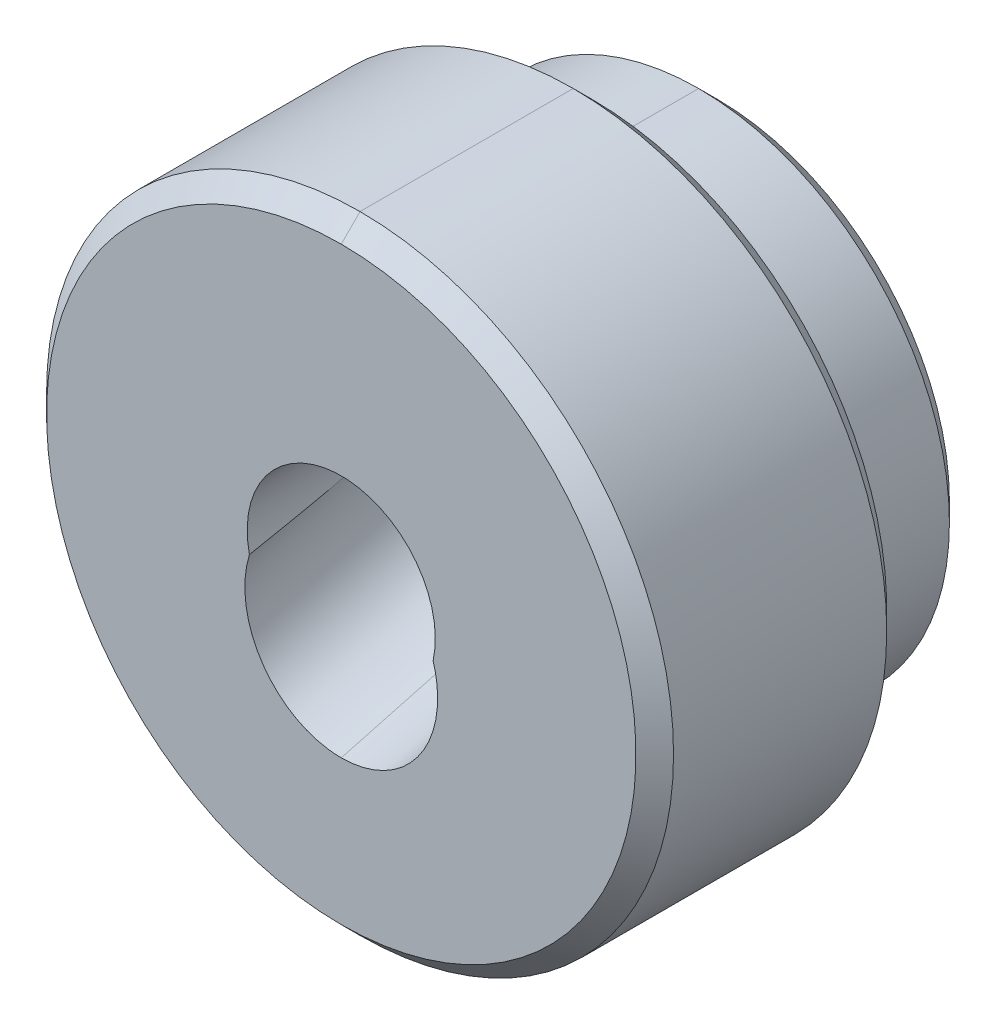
ISO-10303-21;
HEADER;
FILE_DESCRIPTION(('STEP AP214'),'2;1');
FILE_NAME('part.step','',(''),(''),'','','');
FILE_SCHEMA(('AUTOMOTIVE_DESIGN { 1 0 10303 214 1 1 1 1 }'));
ENDSEC;
DATA;
#1=APPLICATION_CONTEXT('core data for automotive mechanical design processes');
#2=APPLICATION_PROTOCOL_DEFINITION('international standard','automotive_design',2000,#1);
#3=PRODUCT_CONTEXT('',#1,'mechanical');
#4=PRODUCT('Part','Part','',(#3));
#5=PRODUCT_RELATED_PRODUCT_CATEGORY('part','',(#4));
#6=PRODUCT_DEFINITION_FORMATION('','',#4);
#7=PRODUCT_DEFINITION_CONTEXT('part definition',#1,'design');
#8=PRODUCT_DEFINITION('design','',#6,#7);
#9=PRODUCT_DEFINITION_SHAPE('','',#8);
#10=(LENGTH_UNIT() NAMED_UNIT(*) SI_UNIT(.MILLI.,.METRE.));
#11=(NAMED_UNIT(*) PLANE_ANGLE_UNIT() SI_UNIT($,.RADIAN.));
#12=(NAMED_UNIT(*) SI_UNIT($,.STERADIAN.) SOLID_ANGLE_UNIT());
#13=UNCERTAINTY_MEASURE_WITH_UNIT(LENGTH_MEASURE(1.E-05),#10,'distance_accuracy_value','');
#14=(GEOMETRIC_REPRESENTATION_CONTEXT(3) GLOBAL_UNCERTAINTY_ASSIGNED_CONTEXT((#13)) GLOBAL_UNIT_ASSIGNED_CONTEXT((#10,
#11,#12)) REPRESENTATION_CONTEXT('',''));
#15=CARTESIAN_POINT('',(0.,0.,0.));
#16=DIRECTION('',(0.,0.,1.));
#17=DIRECTION('',(1.,0.,0.));
#18=AXIS2_PLACEMENT_3D('',#15,#16,#17);
#19=CARTESIAN_POINT('',(0.,0.,6.8));
#20=DIRECTION('',(0.,0.,1.));
#21=DIRECTION('',(1.,0.,0.));
#22=AXIS2_PLACEMENT_3D('',#19,#20,#21);
#23=CYLINDRICAL_SURFACE('',#22,16.);
#24=CARTESIAN_POINT('',(0.,0.,6.8));
#25=DIRECTION('',(0.,0.,1.));
#26=DIRECTION('',(1.,0.,0.));
#27=AXIS2_PLACEMENT_3D('',#24,#25,#26);
#28=CIRCLE('',#27,16.);
#29=CARTESIAN_POINT('',(-16.,0.,6.8));
#30=VERTEX_POINT('',#29);
#31=CARTESIAN_POINT('',(0.,-16.,6.8));
#32=VERTEX_POINT('',#31);
#33=EDGE_CURVE('E409',#30,#32,#28,.T.);
#34=ORIENTED_EDGE('',*,*,#33,.F.);
#35=CARTESIAN_POINT('',(0.,0.,6.8));
#36=DIRECTION('',(0.,0.,1.));
#37=DIRECTION('',(1.,0.,0.));
#38=AXIS2_PLACEMENT_3D('',#35,#36,#37);
#39=CIRCLE('',#38,16.);
#40=CARTESIAN_POINT('',(0.,16.,6.8));
#41=VERTEX_POINT('',#40);
#42=EDGE_CURVE('E278',#41,#30,#39,.T.);
#43=ORIENTED_EDGE('',*,*,#42,.F.);
#44=DIRECTION('',(0.,0.,1.));
#45=VECTOR('',#44,1.);
#46=CARTESIAN_POINT('',(0.,16.,4.));
#47=LINE('',#46,#45);
#48=CARTESIAN_POINT('',(0.,16.,1.2));
#49=VERTEX_POINT('',#48);
#50=EDGE_CURVE('E115',#49,#41,#47,.T.);
#51=ORIENTED_EDGE('',*,*,#50,.F.);
#52=CARTESIAN_POINT('',(0.,0.,1.2));
#53=DIRECTION('',(0.,0.,-1.));
#54=DIRECTION('',(0.,1.,0.));
#55=AXIS2_PLACEMENT_3D('',#52,#53,#54);
#56=CIRCLE('',#55,16.);
#57=CARTESIAN_POINT('',(0.,-16.,1.2));
#58=VERTEX_POINT('',#57);
#59=EDGE_CURVE('E184',#58,#49,#56,.T.);
#60=ORIENTED_EDGE('',*,*,#59,.F.);
#61=DIRECTION('',(0.,0.,-1.));
#62=VECTOR('',#61,1.);
#63=CARTESIAN_POINT('',(0.,-16.,4.));
#64=LINE('',#63,#62);
#65=EDGE_CURVE('E411',#32,#58,#64,.T.);
#66=ORIENTED_EDGE('',*,*,#65,.F.);
#67=EDGE_LOOP('',(#34,#43,#51,#60,#66));
#68=FACE_BOUND('',#67,.T.);
#69=ADVANCED_FACE('F14',(#68),#23,.T.);
#70=CARTESIAN_POINT('',(0.,0.,6.8));
#71=DIRECTION('',(0.,0.,1.));
#72=DIRECTION('',(1.,0.,0.));
#73=AXIS2_PLACEMENT_3D('',#70,#71,#72);
#74=CYLINDRICAL_SURFACE('',#73,16.);
#75=ORIENTED_EDGE('',*,*,#65,.T.);
#76=CARTESIAN_POINT('',(0.,0.,1.2));
#77=DIRECTION('',(0.,0.,-1.));
#78=DIRECTION('',(0.,1.,0.));
#79=AXIS2_PLACEMENT_3D('',#76,#77,#78);
#80=CIRCLE('',#79,16.);
#81=EDGE_CURVE('E168',#49,#58,#80,.T.);
#82=ORIENTED_EDGE('',*,*,#81,.F.);
#83=ORIENTED_EDGE('',*,*,#50,.T.);
#84=CARTESIAN_POINT('',(0.,0.,6.8));
#85=DIRECTION('',(0.,0.,1.));
#86=DIRECTION('',(1.,0.,0.));
#87=AXIS2_PLACEMENT_3D('',#84,#85,#86);
#88=CIRCLE('',#87,16.);
#89=CARTESIAN_POINT('',(16.,0.,6.8));
#90=VERTEX_POINT('',#89);
#91=EDGE_CURVE('E276',#90,#41,#88,.T.);
#92=ORIENTED_EDGE('',*,*,#91,.F.);
#93=CARTESIAN_POINT('',(0.,0.,6.8));
#94=DIRECTION('',(0.,0.,1.));
#95=DIRECTION('',(1.,0.,0.));
#96=AXIS2_PLACEMENT_3D('',#93,#94,#95);
#97=CIRCLE('',#96,16.);
#98=EDGE_CURVE('E220',#32,#90,#97,.T.);
#99=ORIENTED_EDGE('',*,*,#98,.F.);
#100=EDGE_LOOP('',(#75,#82,#83,#92,#99));
#101=FACE_BOUND('',#100,.T.);
#102=ADVANCED_FACE('F403',(#101),#74,.T.);
#103=CARTESIAN_POINT('',(0.,0.,6.8));
#104=DIRECTION('',(0.,0.,1.));
#105=DIRECTION('',(1.,0.,0.));
#106=AXIS2_PLACEMENT_3D('',#103,#104,#105);
#107=TOROIDAL_SURFACE('',#106,17.2,1.2);
#108=CARTESIAN_POINT('',(17.2,0.,6.8));
#109=DIRECTION('',(0.,-1.,0.));
#110=DIRECTION('',(-1.,0.,0.));
#111=AXIS2_PLACEMENT_3D('',#108,#109,#110);
#112=CIRCLE('',#111,1.2);
#113=CARTESIAN_POINT('',(17.2,0.,8.));
#114=VERTEX_POINT('',#113);
#115=EDGE_CURVE('E219',#114,#90,#112,.T.);
#116=ORIENTED_EDGE('',*,*,#115,.F.);
#117=CARTESIAN_POINT('',(0.,0.,8.));
#118=DIRECTION('',(0.,0.,-1.));
#119=DIRECTION('',(1.,0.,0.));
#120=AXIS2_PLACEMENT_3D('',#117,#118,#119);
#121=CIRCLE('',#120,17.2);
#122=CARTESIAN_POINT('',(-17.2,0.,8.));
#123=VERTEX_POINT('',#122);
#124=EDGE_CURVE('E156',#123,#114,#121,.F.);
#125=ORIENTED_EDGE('',*,*,#124,.F.);
#126=CARTESIAN_POINT('',(-17.2,0.,6.8));
#127=DIRECTION('',(0.,1.,0.));
#128=DIRECTION('',(1.,0.,0.));
#129=AXIS2_PLACEMENT_3D('',#126,#127,#128);
#130=CIRCLE('',#129,1.2);
#131=EDGE_CURVE('E212',#30,#123,#130,.F.);
#132=ORIENTED_EDGE('',*,*,#131,.F.);
#133=ORIENTED_EDGE('',*,*,#33,.T.);
#134=ORIENTED_EDGE('',*,*,#98,.T.);
#135=EDGE_LOOP('',(#116,#125,#132,#133,#134));
#136=FACE_BOUND('',#135,.T.);
#137=ADVANCED_FACE('F197',(#136),#107,.F.);
#138=CARTESIAN_POINT('',(0.,0.,6.8));
#139=DIRECTION('',(0.,0.,1.));
#140=DIRECTION('',(1.,0.,0.));
#141=AXIS2_PLACEMENT_3D('',#138,#139,#140);
#142=TOROIDAL_SURFACE('',#141,17.2,1.2);
#143=ORIENTED_EDGE('',*,*,#91,.T.);
#144=ORIENTED_EDGE('',*,*,#42,.T.);
#145=ORIENTED_EDGE('',*,*,#131,.T.);
#146=CARTESIAN_POINT('',(0.,0.,8.));
#147=DIRECTION('',(0.,0.,-1.));
#148=DIRECTION('',(-1.,0.,0.));
#149=AXIS2_PLACEMENT_3D('',#146,#147,#148);
#150=CIRCLE('',#149,17.2);
#151=CARTESIAN_POINT('',(0.,17.2,8.));
#152=VERTEX_POINT('',#151);
#153=EDGE_CURVE('E162',#152,#123,#150,.F.);
#154=ORIENTED_EDGE('',*,*,#153,.F.);
#155=CARTESIAN_POINT('',(0.,0.,8.));
#156=DIRECTION('',(0.,0.,-1.));
#157=DIRECTION('',(0.,1.,0.));
#158=AXIS2_PLACEMENT_3D('',#155,#156,#157);
#159=CIRCLE('',#158,17.2);
#160=EDGE_CURVE('E151',#114,#152,#159,.F.);
#161=ORIENTED_EDGE('',*,*,#160,.F.);
#162=ORIENTED_EDGE('',*,*,#115,.T.);
#163=EDGE_LOOP('',(#143,#144,#145,#154,#161,#162));
#164=FACE_BOUND('',#163,.T.);
#165=ADVANCED_FACE('F191',(#164),#142,.F.);
#166=CARTESIAN_POINT('',(0.,0.,0.));
#167=DIRECTION('',(0.,0.,1.));
#168=DIRECTION('',(1.,0.,0.));
#169=AXIS2_PLACEMENT_3D('',#166,#167,#168);
#170=CONICAL_SURFACE('',#169,14.8,0.785398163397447);
#171=DIRECTION('',(0.,0.707106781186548,-0.707106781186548));
#172=VECTOR('',#171,1.);
#173=CARTESIAN_POINT('',(0.,-11.3137084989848,-3.48629150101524));
#174=LINE('',#173,#172);
#175=CARTESIAN_POINT('',(0.,-14.8,0.));
#176=VERTEX_POINT('',#175);
#177=EDGE_CURVE('E165',#58,#176,#174,.T.);
#178=ORIENTED_EDGE('',*,*,#177,.F.);
#179=ORIENTED_EDGE('',*,*,#59,.T.);
#180=DIRECTION('',(0.,0.707106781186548,0.707106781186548));
#181=VECTOR('',#180,1.);
#182=CARTESIAN_POINT('',(0.,11.3137084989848,-3.48629150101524));
#183=LINE('',#182,#181);
#184=CARTESIAN_POINT('',(0.,14.8,0.));
#185=VERTEX_POINT('',#184);
#186=EDGE_CURVE('E174',#185,#49,#183,.T.);
#187=ORIENTED_EDGE('',*,*,#186,.F.);
#188=CARTESIAN_POINT('',(0.,0.,0.));
#189=DIRECTION('',(0.,0.,1.));
#190=DIRECTION('',(1.,0.,0.));
#191=AXIS2_PLACEMENT_3D('',#188,#189,#190);
#192=CIRCLE('',#191,14.8);
#193=EDGE_CURVE('E148',#176,#185,#192,.F.);
#194=ORIENTED_EDGE('',*,*,#193,.F.);
#195=EDGE_LOOP('',(#178,#179,#187,#194));
#196=FACE_BOUND('',#195,.T.);
#197=ADVANCED_FACE('F196',(#196),#170,.T.);
#198=CARTESIAN_POINT('',(0.,0.,0.));
#199=DIRECTION('',(0.,0.,1.));
#200=DIRECTION('',(1.,0.,0.));
#201=AXIS2_PLACEMENT_3D('',#198,#199,#200);
#202=CONICAL_SURFACE('',#201,14.8,0.785398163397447);
#203=ORIENTED_EDGE('',*,*,#177,.T.);
#204=CARTESIAN_POINT('',(0.,0.,0.));
#205=DIRECTION('',(0.,0.,1.));
#206=DIRECTION('',(1.,0.,0.));
#207=AXIS2_PLACEMENT_3D('',#204,#205,#206);
#208=CIRCLE('',#207,14.8);
#209=EDGE_CURVE('E145',#185,#176,#208,.F.);
#210=ORIENTED_EDGE('',*,*,#209,.F.);
#211=ORIENTED_EDGE('',*,*,#186,.T.);
#212=ORIENTED_EDGE('',*,*,#81,.T.);
#213=EDGE_LOOP('',(#203,#210,#211,#212));
#214=FACE_BOUND('',#213,.T.);
#215=ADVANCED_FACE('F238',(#214),#202,.T.);
#216=CARTESIAN_POINT('',(19.0256021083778,18.8,8.));
#217=DIRECTION('',(0.,0.,-1.));
#218=DIRECTION('',(0.,-1.,0.));
#219=AXIS2_PLACEMENT_3D('',#216,#217,#218);
#220=PLANE('',#219);
#221=ORIENTED_EDGE('',*,*,#124,.T.);
#222=ORIENTED_EDGE('',*,*,#160,.T.);
#223=ORIENTED_EDGE('',*,*,#153,.T.);
#224=EDGE_LOOP('',(#221,#222,#223));
#225=FACE_BOUND('',#224,.T.);
#226=CARTESIAN_POINT('',(0.,0.,8.));
#227=DIRECTION('',(0.,0.,1.));
#228=DIRECTION('',(1.,0.,0.));
#229=AXIS2_PLACEMENT_3D('',#226,#227,#228);
#230=CIRCLE('',#229,18.8);
#231=CARTESIAN_POINT('',(0.,18.8,8.));
#232=VERTEX_POINT('',#231);
#233=CARTESIAN_POINT('',(0.,-18.8,8.));
#234=VERTEX_POINT('',#233);
#235=EDGE_CURVE('E140',#232,#234,#230,.T.);
#236=ORIENTED_EDGE('',*,*,#235,.F.);
#237=CARTESIAN_POINT('',(0.,0.,8.));
#238=DIRECTION('',(0.,0.,1.));
#239=DIRECTION('',(1.,0.,0.));
#240=AXIS2_PLACEMENT_3D('',#237,#238,#239);
#241=CIRCLE('',#240,18.8);
#242=EDGE_CURVE('E150',#234,#232,#241,.T.);
#243=ORIENTED_EDGE('',*,*,#242,.F.);
#244=EDGE_LOOP('',(#236,#243));
#245=FACE_BOUND('',#244,.T.);
#246=ADVANCED_FACE('F228',(#225,#245),#220,.T.);
#247=CARTESIAN_POINT('',(0.,0.,8.));
#248=DIRECTION('',(0.,0.,1.));
#249=DIRECTION('',(1.,0.,0.));
#250=AXIS2_PLACEMENT_3D('',#247,#248,#249);
#251=CONICAL_SURFACE('',#250,18.8,0.785398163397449);
#252=DIRECTION('',(0.,-0.707106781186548,0.707106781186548));
#253=VECTOR('',#252,1.);
#254=CARTESIAN_POINT('',(0.,-14.1421356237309,3.34213562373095));
#255=LINE('',#254,#253);
#256=CARTESIAN_POINT('',(0.,-20.,9.2));
#257=VERTEX_POINT('',#256);
#258=EDGE_CURVE('E143',#234,#257,#255,.T.);
#259=ORIENTED_EDGE('',*,*,#258,.F.);
#260=ORIENTED_EDGE('',*,*,#242,.T.);
#261=DIRECTION('',(0.,-0.707106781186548,-0.707106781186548));
#262=VECTOR('',#261,1.);
#263=CARTESIAN_POINT('',(0.,14.1421356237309,3.34213562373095));
#264=LINE('',#263,#262);
#265=CARTESIAN_POINT('',(0.,20.,9.2));
#266=VERTEX_POINT('',#265);
#267=EDGE_CURVE('E144',#266,#232,#264,.T.);
#268=ORIENTED_EDGE('',*,*,#267,.F.);
#269=CARTESIAN_POINT('',(0.,0.,9.2));
#270=DIRECTION('',(0.,0.,1.));
#271=DIRECTION('',(0.,1.,0.));
#272=AXIS2_PLACEMENT_3D('',#269,#270,#271);
#273=CIRCLE('',#272,20.);
#274=EDGE_CURVE('E327',#257,#266,#273,.T.);
#275=ORIENTED_EDGE('',*,*,#274,.F.);
#276=EDGE_LOOP('',(#259,#260,#268,#275));
#277=FACE_BOUND('',#276,.T.);
#278=ADVANCED_FACE('F237',(#277),#251,.T.);
#279=CARTESIAN_POINT('',(14.9776021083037,14.8,0.));
#280=DIRECTION('',(0.,0.,-1.));
#281=DIRECTION('',(0.,-1.,0.));
#282=AXIS2_PLACEMENT_3D('',#279,#280,#281);
#283=PLANE('',#282);
#284=CARTESIAN_POINT('',(0.,0.,0.));
#285=DIRECTION('',(0.,0.,-1.));
#286=DIRECTION('',(-1.,0.,0.));
#287=AXIS2_PLACEMENT_3D('',#284,#285,#286);
#288=CIRCLE('',#287,6.);
#289=CARTESIAN_POINT('',(5.86067408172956,1.28549574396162,0.));
#290=VERTEX_POINT('',#289);
#291=CARTESIAN_POINT('',(-5.86067408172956,1.28549574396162,0.));
#292=VERTEX_POINT('',#291);
#293=EDGE_CURVE('E28',#290,#292,#288,.T.);
#294=ORIENTED_EDGE('',*,*,#293,.F.);
#295=CARTESIAN_POINT('',(0.,3.21539030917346,0.));
#296=DIRECTION('',(0.,0.,-1.));
#297=DIRECTION('',(0.,-1.,0.));
#298=AXIS2_PLACEMENT_3D('',#295,#296,#297);
#299=ELLIPSE('',#298,6.366948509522,6.15);
#300=CARTESIAN_POINT('',(0.,9.58233881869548,0.));
#301=VERTEX_POINT('',#300);
#302=EDGE_CURVE('E122',#301,#290,#299,.T.);
#303=ORIENTED_EDGE('',*,*,#302,.F.);
#304=CARTESIAN_POINT('',(0.,3.21539030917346,0.));
#305=DIRECTION('',(0.,0.,-1.));
#306=DIRECTION('',(0.,-1.,0.));
#307=AXIS2_PLACEMENT_3D('',#304,#305,#306);
#308=ELLIPSE('',#307,6.366948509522,6.15);
#309=EDGE_CURVE('E124',#292,#301,#308,.T.);
#310=ORIENTED_EDGE('',*,*,#309,.F.);
#311=EDGE_LOOP('',(#294,#303,#310));
#312=FACE_BOUND('',#311,.T.);
#313=ORIENTED_EDGE('',*,*,#193,.T.);
#314=ORIENTED_EDGE('',*,*,#209,.T.);
#315=EDGE_LOOP('',(#313,#314));
#316=FACE_BOUND('',#315,.T.);
#317=ADVANCED_FACE('F120',(#312,#316),#283,.T.);
#318=CARTESIAN_POINT('',(0.,0.,8.));
#319=DIRECTION('',(0.,0.,1.));
#320=DIRECTION('',(1.,0.,0.));
#321=AXIS2_PLACEMENT_3D('',#318,#319,#320);
#322=CONICAL_SURFACE('',#321,18.8,0.785398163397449);
#323=ORIENTED_EDGE('',*,*,#258,.T.);
#324=CARTESIAN_POINT('',(0.,0.,9.2));
#325=DIRECTION('',(0.,0.,1.));
#326=DIRECTION('',(0.,1.,0.));
#327=AXIS2_PLACEMENT_3D('',#324,#325,#326);
#328=CIRCLE('',#327,20.);
#329=EDGE_CURVE('E303',#266,#257,#328,.T.);
#330=ORIENTED_EDGE('',*,*,#329,.F.);
#331=ORIENTED_EDGE('',*,*,#267,.T.);
#332=ORIENTED_EDGE('',*,*,#235,.T.);
#333=EDGE_LOOP('',(#323,#330,#331,#332));
#334=FACE_BOUND('',#333,.T.);
#335=ADVANCED_FACE('F429',(#334),#322,.T.);
#336=CARTESIAN_POINT('',(0.,0.,22.8));
#337=DIRECTION('',(0.,0.,1.));
#338=DIRECTION('',(1.,0.,0.));
#339=AXIS2_PLACEMENT_3D('',#336,#337,#338);
#340=CYLINDRICAL_SURFACE('',#339,20.);
#341=DIRECTION('',(0.,0.,1.));
#342=VECTOR('',#341,1.);
#343=CARTESIAN_POINT('',(0.,-20.,16.));
#344=LINE('',#343,#342);
#345=CARTESIAN_POINT('',(0.,-20.,22.8));
#346=VERTEX_POINT('',#345);
#347=EDGE_CURVE('E298',#257,#346,#344,.T.);
#348=ORIENTED_EDGE('',*,*,#347,.F.);
#349=ORIENTED_EDGE('',*,*,#274,.T.);
#350=DIRECTION('',(0.,0.,-1.));
#351=VECTOR('',#350,1.);
#352=CARTESIAN_POINT('',(0.,20.,16.));
#353=LINE('',#352,#351);
#354=CARTESIAN_POINT('',(0.,20.,22.8));
#355=VERTEX_POINT('',#354);
#356=EDGE_CURVE('E310',#355,#266,#353,.T.);
#357=ORIENTED_EDGE('',*,*,#356,.F.);
#358=CARTESIAN_POINT('',(0.,0.,22.8));
#359=DIRECTION('',(0.,0.,1.));
#360=DIRECTION('',(0.,1.,0.));
#361=AXIS2_PLACEMENT_3D('',#358,#359,#360);
#362=CIRCLE('',#361,20.);
#363=EDGE_CURVE('E130',#346,#355,#362,.T.);
#364=ORIENTED_EDGE('',*,*,#363,.F.);
#365=EDGE_LOOP('',(#348,#349,#357,#364));
#366=FACE_BOUND('',#365,.T.);
#367=ADVANCED_FACE('F349',(#366),#340,.T.);
#368=CARTESIAN_POINT('',(0.,0.,24.));
#369=DIRECTION('',(0.,0.,-1.));
#370=DIRECTION('',(-1.,0.,0.));
#371=AXIS2_PLACEMENT_3D('',#368,#369,#370);
#372=CONICAL_SURFACE('',#371,18.8,0.785398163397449);
#373=DIRECTION('',(0.,-0.707106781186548,-0.707106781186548));
#374=VECTOR('',#373,1.);
#375=CARTESIAN_POINT('',(0.,-14.1421356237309,28.657864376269));
#376=LINE('',#375,#374);
#377=CARTESIAN_POINT('',(0.,-18.8,24.));
#378=VERTEX_POINT('',#377);
#379=EDGE_CURVE('E135',#378,#346,#376,.T.);
#380=ORIENTED_EDGE('',*,*,#379,.T.);
#381=ORIENTED_EDGE('',*,*,#363,.T.);
#382=DIRECTION('',(0.,-0.707106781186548,0.707106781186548));
#383=VECTOR('',#382,1.);
#384=CARTESIAN_POINT('',(0.,14.1421356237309,28.657864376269));
#385=LINE('',#384,#383);
#386=CARTESIAN_POINT('',(0.,18.8,24.));
#387=VERTEX_POINT('',#386);
#388=EDGE_CURVE('E330',#355,#387,#385,.T.);
#389=ORIENTED_EDGE('',*,*,#388,.T.);
#390=CARTESIAN_POINT('',(0.,0.,24.));
#391=DIRECTION('',(0.,0.,-1.));
#392=DIRECTION('',(-1.,0.,0.));
#393=AXIS2_PLACEMENT_3D('',#390,#391,#392);
#394=CIRCLE('',#393,18.8);
#395=EDGE_CURVE('E296',#378,#387,#394,.F.);
#396=ORIENTED_EDGE('',*,*,#395,.F.);
#397=EDGE_LOOP('',(#380,#381,#389,#396));
#398=FACE_BOUND('',#397,.T.);
#399=ADVANCED_FACE('F350',(#398),#372,.T.);
#400=CARTESIAN_POINT('',(0.,3.64199070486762,-1.5920943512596));
#401=DIRECTION('',(0.,-0.25881904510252,0.965925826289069));
#402=DIRECTION('',(0.,-0.965925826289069,-0.25881904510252));
#403=AXIS2_PLACEMENT_3D('',#400,#401,#402);
#404=CYLINDRICAL_SURFACE('',#403,6.15);
#405=CARTESIAN_POINT('',(0.,6.,13.3694704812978));
#406=CARTESIAN_POINT('',(0.168780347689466,6.00001823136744,13.3694814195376));
#407=CARTESIAN_POINT('',(0.337557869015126,5.99287906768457,13.3692044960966));
#408=CARTESIAN_POINT('',(0.673902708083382,5.96441776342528,13.3681525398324));
#409=CARTESIAN_POINT('',(0.841470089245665,5.94309637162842,13.3673775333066));
#410=CARTESIAN_POINT('',(1.17399736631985,5.88643831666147,13.3654082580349));
#411=CARTESIAN_POINT('',(1.33896029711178,5.85111944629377,13.364214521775));
#412=CARTESIAN_POINT('',(1.66532356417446,5.76672366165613,13.3615675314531));
#413=CARTESIAN_POINT('',(1.82672395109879,5.7176469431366,13.3601142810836));
#414=CARTESIAN_POINT('',(2.14487363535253,5.60606325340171,13.3571801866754));
#415=CARTESIAN_POINT('',(2.30162136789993,5.54355182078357,13.35569933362));
#416=CARTESIAN_POINT('',(2.60930238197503,5.40554987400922,13.3530385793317));
#417=CARTESIAN_POINT('',(2.76023553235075,5.33005906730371,13.3518586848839));
#418=CARTESIAN_POINT('',(3.05531259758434,5.16657848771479,13.3502485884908));
#419=CARTESIAN_POINT('',(3.19945184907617,5.0785802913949,13.3498188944));
#420=CARTESIAN_POINT('',(3.47979540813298,4.89075549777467,13.3503250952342));
#421=CARTESIAN_POINT('',(3.6160001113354,4.79092949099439,13.35126092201));
#422=CARTESIAN_POINT('',(3.87952816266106,4.58014600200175,13.3553436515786));
#423=CARTESIAN_POINT('',(4.00684936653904,4.46918584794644,13.3584910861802));
#424=CARTESIAN_POINT('',(4.2516191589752,4.23700146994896,13.3681790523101));
#425=CARTESIAN_POINT('',(4.36906851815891,4.1157780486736,13.3747193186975));
#426=CARTESIAN_POINT('',(4.59305507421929,3.8642182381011,13.3928711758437));
#427=CARTESIAN_POINT('',(4.69960408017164,3.73389197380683,13.4044772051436));
#428=CARTESIAN_POINT('',(4.90096828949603,3.46534480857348,13.435190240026));
#429=CARTESIAN_POINT('',(4.99579166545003,3.32712950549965,13.4542919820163));
#430=CARTESIAN_POINT('',(5.13279318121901,3.1085053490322,13.4924662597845));
#431=CARTESIAN_POINT('',(5.17940970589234,3.03017437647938,13.5076575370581));
#432=CARTESIAN_POINT('',(5.26866262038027,2.87217978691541,13.5421786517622));
#433=CARTESIAN_POINT('',(5.31130021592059,2.79251658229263,13.5615072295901));
#434=CARTESIAN_POINT('',(5.39236797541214,2.63256289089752,13.6051890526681));
#435=CARTESIAN_POINT('',(5.43080435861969,2.55227352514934,13.6295347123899));
#436=CARTESIAN_POINT('',(5.50335854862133,2.39182209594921,13.6842533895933));
#437=CARTESIAN_POINT('',(5.53747730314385,2.3116600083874,13.7146250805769));
#438=CARTESIAN_POINT('',(5.62101887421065,2.10316639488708,13.80347151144));
#439=CARTESIAN_POINT('',(5.66684725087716,1.97572288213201,13.867706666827));
#440=CARTESIAN_POINT('',(5.74657020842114,1.7302050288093,14.017368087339));
#441=CARTESIAN_POINT('',(5.78049567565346,1.61210706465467,14.1027385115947));
#442=CARTESIAN_POINT('',(5.83780423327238,1.39040972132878,14.2931890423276));
#443=CARTESIAN_POINT('',(5.86119705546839,1.28679701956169,14.3982508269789));
#444=CARTESIAN_POINT('',(5.8999947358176,1.09529616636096,14.6233319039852));
#445=CARTESIAN_POINT('',(5.91537729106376,1.00745236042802,14.7433918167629));
#446=CARTESIAN_POINT('',(5.94298066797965,0.830913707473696,15.0161683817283));
#447=CARTESIAN_POINT('',(5.95408396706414,0.745089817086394,15.1708092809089));
#448=CARTESIAN_POINT('',(5.97161176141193,0.588244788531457,15.4877939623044));
#449=CARTESIAN_POINT('',(5.9780266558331,0.517254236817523,15.6501528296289));
#450=CARTESIAN_POINT('',(5.98800532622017,0.385008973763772,15.9816153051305));
#451=CARTESIAN_POINT('',(5.99152481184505,0.323916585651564,16.1507836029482));
#452=CARTESIAN_POINT('',(5.99660583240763,0.209678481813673,16.4915801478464));
#453=CARTESIAN_POINT('',(5.99816922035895,0.156525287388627,16.6632059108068));
#454=CARTESIAN_POINT('',(5.99998983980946,0.0536744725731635,17.0158791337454));
#455=CARTESIAN_POINT('',(6.00018507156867,0.00424031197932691,17.1970027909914));
#456=CARTESIAN_POINT('',(5.99950823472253,-0.0900339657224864,17.5604475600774));
#457=CARTESIAN_POINT('',(5.99863604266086,-0.134873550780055,17.7427688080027));
#458=CARTESIAN_POINT('',(5.99480328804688,-0.264316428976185,18.2910784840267));
#459=CARTESIAN_POINT('',(5.99062625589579,-0.343801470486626,18.6582591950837));
#460=CARTESIAN_POINT('',(5.98003582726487,-0.494797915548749,19.3950277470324));
#461=CARTESIAN_POINT('',(5.9736174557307,-0.566291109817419,19.7646191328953));
#462=CARTESIAN_POINT('',(5.95896615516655,-0.703924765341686,20.5046588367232));
#463=CARTESIAN_POINT('',(5.95073369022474,-0.77006658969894,20.8751069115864));
#464=CARTESIAN_POINT('',(5.93357638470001,-0.892226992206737,21.5792082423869));
#465=CARTESIAN_POINT('',(5.924805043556,-0.948593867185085,21.9128054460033));
#466=CARTESIAN_POINT('',(5.90604157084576,-1.05915820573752,22.5803507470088));
#467=CARTESIAN_POINT('',(5.89604934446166,-1.1133555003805,22.9142988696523));
#468=CARTESIAN_POINT('',(5.8749300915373,-1.21989183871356,23.5810432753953));
#469=CARTESIAN_POINT('',(5.86380790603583,-1.27223761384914,23.9138386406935));
#470=CARTESIAN_POINT('',(5.84041069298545,-1.37564210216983,24.57955595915));
#471=CARTESIAN_POINT('',(5.82813577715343,-1.42670093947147,24.9124778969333));
#472=CARTESIAN_POINT('',(5.81529133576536,-1.47729031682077,25.2454478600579));
#473=B_SPLINE_CURVE_WITH_KNOTS('',3,(#405,#406,#407,#408,#409,#410,#411,#412,#413,#414,#415,
#416,#417,#418,#419,#420,#421,#422,#423,#424,#425,#426,#427,#428,#429,#430,#431,#432,#433,#434,
#435,#436,#437,#438,#439,#440,#441,#442,#443,#444,#445,#446,#447,#448,#449,#450,#451,#452,#453,
#454,#455,#456,#457,#458,#459,#460,#461,#462,#463,#464,#465,#466,#467,#468,#469,#470,#471,#472),
.UNSPECIFIED.,.F.,.F.,(4,2,2,2,2,2,2,2,2,2,2,2,2,2,2,2,2,2,2,2,2,2,2,2,2,2,2,2,2,2,2,2,2,4),(0.,
0.506185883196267,1.01234504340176,1.51786285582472,2.02337347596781,2.52905222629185,
3.03474237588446,3.54077472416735,4.04678181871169,4.55291063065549,5.05899989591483,
5.56453494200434,6.06971562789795,6.34679221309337,6.62378456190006,6.90036114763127,
7.17687691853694,7.62450130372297,8.07095542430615,8.51699618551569,8.9642723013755,
9.49460401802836,10.0260187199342,10.5654186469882,11.104307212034,11.6674669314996,
12.2306917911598,13.3576192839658,14.487064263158,15.6162206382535,16.6315288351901,
17.6469159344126,18.6581229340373,19.6692320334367),.UNSPECIFIED.);
#474=CARTESIAN_POINT('',(0.,6.,13.3694704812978));
#475=VERTEX_POINT('',#474);
#476=CARTESIAN_POINT('',(5.86067408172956,-1.2854957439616,24.));
#477=VERTEX_POINT('',#476);
#478=EDGE_CURVE('E35',#475,#477,#473,.T.);
#479=ORIENTED_EDGE('',*,*,#478,.F.);
#480=DIRECTION('',(0.,-0.258819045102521,0.965925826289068));
#481=VECTOR('',#480,1.);
#482=CARTESIAN_POINT('',(0.,5.94044383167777,13.5917371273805));
#483=LINE('',#482,#481);
#484=EDGE_CURVE('E129',#301,#475,#483,.T.);
#485=ORIENTED_EDGE('',*,*,#484,.F.);
#486=ORIENTED_EDGE('',*,*,#302,.T.);
#487=CARTESIAN_POINT('',(0.,-6.,10.6305295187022));
#488=CARTESIAN_POINT('',(0.168780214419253,-6.00001823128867,10.6305185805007));
#489=CARTESIAN_POINT('',(0.33755760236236,-5.99287907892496,10.6307955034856));
#490=CARTESIAN_POINT('',(0.673902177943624,-5.96441781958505,10.6318474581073));
#491=CARTESIAN_POINT('',(0.841469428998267,-5.94309646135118,10.632622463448));
#492=CARTESIAN_POINT('',(1.1739967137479,-5.88643845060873,10.6345917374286));
#493=CARTESIAN_POINT('',(1.33895977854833,-5.85111956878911,10.6357854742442));
#494=CARTESIAN_POINT('',(1.66532330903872,-5.76672373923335,10.638432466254));
#495=CARTESIAN_POINT('',(1.82672382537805,-5.71764698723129,10.6398857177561));
#496=CARTESIAN_POINT('',(2.14487382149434,-5.60606318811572,10.6428198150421));
#497=CARTESIAN_POINT('',(2.30162173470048,-5.54355167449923,10.644300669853));
#498=CARTESIAN_POINT('',(2.60930309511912,-5.40554953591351,10.6469614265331));
#499=CARTESIAN_POINT('',(2.76023641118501,-5.33005861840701,10.6481413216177));
#500=CARTESIAN_POINT('',(3.05531344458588,-5.16657798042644,10.6497514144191));
#501=CARTESIAN_POINT('',(3.19945251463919,-5.07857986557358,10.6501811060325));
#502=CARTESIAN_POINT('',(3.47979572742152,-4.89075526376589,10.6496749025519));
#503=CARTESIAN_POINT('',(3.61600026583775,-4.7909293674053,10.6487390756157));
#504=CARTESIAN_POINT('',(3.87952762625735,-4.58014643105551,10.6446563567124));
#505=CARTESIAN_POINT('',(4.00684832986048,-4.46918675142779,10.6415089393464));
#506=CARTESIAN_POINT('',(4.2516172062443,-4.23700340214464,10.6318210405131));
#507=CARTESIAN_POINT('',(4.36906614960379,-4.1157805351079,10.6252808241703));
#508=CARTESIAN_POINT('',(4.59305288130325,-3.86422087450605,10.6071290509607));
#509=CARTESIAN_POINT('',(4.69960239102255,-3.73389413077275,10.5955230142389));
#510=CARTESIAN_POINT('',(4.9009675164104,-3.46534593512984,10.5648099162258));
#511=CARTESIAN_POINT('',(4.99579130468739,-3.32713008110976,10.5457081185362));
#512=CARTESIAN_POINT('',(5.13279372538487,-3.1085044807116,10.5075335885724));
#513=CARTESIAN_POINT('',(5.17941075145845,-3.03017261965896,10.492342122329));
#514=CARTESIAN_POINT('',(5.268664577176,-2.8721762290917,10.4578205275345));
#515=CARTESIAN_POINT('',(5.31130258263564,-2.79251211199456,10.4384916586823));
#516=CARTESIAN_POINT('',(5.39237015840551,-2.63255838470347,10.3948096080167));
#517=CARTESIAN_POINT('',(5.43080604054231,-2.55226991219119,10.3704641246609));
#518=CARTESIAN_POINT('',(5.50335931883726,-2.39182028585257,10.3157459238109));
#519=CARTESIAN_POINT('',(5.53747766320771,-2.31165910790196,10.2853745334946));
#520=CARTESIAN_POINT('',(5.62101765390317,-2.10316944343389,10.196529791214));
#521=CARTESIAN_POINT('',(5.66684508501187,-1.97572891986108,10.1322963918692));
#522=CARTESIAN_POINT('',(5.74656858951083,-1.73021064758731,9.98263595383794));
#523=CARTESIAN_POINT('',(5.78049499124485,-1.61210970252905,9.89726374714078));
#524=CARTESIAN_POINT('',(5.83780490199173,-1.39040714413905,9.70680875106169));
#525=CARTESIAN_POINT('',(5.8611981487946,-1.28679220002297,9.60174429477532));
#526=CARTESIAN_POINT('',(5.8999954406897,-1.095292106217,9.37666253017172));
#527=CARTESIAN_POINT('',(5.91537755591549,-1.00745056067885,9.25660528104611));
#528=CARTESIAN_POINT('',(5.94298434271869,-0.830890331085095,8.9837956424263));
#529=CARTESIAN_POINT('',(5.95408950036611,-0.745047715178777,8.82911555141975));
#530=CARTESIAN_POINT('',(5.97161917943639,-0.588171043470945,8.51204703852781));
#531=CARTESIAN_POINT('',(5.97803401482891,-0.517167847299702,8.34964339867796));
#532=CARTESIAN_POINT('',(5.98801037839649,-0.384930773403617,8.01817575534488));
#533=CARTESIAN_POINT('',(5.99152915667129,-0.323853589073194,7.84904930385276));
#534=CARTESIAN_POINT('',(5.99660526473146,-0.209656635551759,7.50833387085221));
#535=CARTESIAN_POINT('',(5.99816444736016,-0.156529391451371,7.33674737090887));
#536=CARTESIAN_POINT('',(6.00064398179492,-0.0171906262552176,6.85912616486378));
#537=CARTESIAN_POINT('',(6.00014701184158,0.0629808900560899,6.55134194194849));
#538=CARTESIAN_POINT('',(5.99668387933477,0.212787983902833,5.93320407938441));
#539=CARTESIAN_POINT('',(5.99371670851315,0.282419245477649,5.62284944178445));
#540=CARTESIAN_POINT('',(5.98600217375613,0.414958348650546,5.00014734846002));
#541=CARTESIAN_POINT('',(5.98125156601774,0.47785366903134,4.68779728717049));
#542=CARTESIAN_POINT('',(5.97033454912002,0.598988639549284,4.06229120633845));
#543=CARTESIAN_POINT('',(5.96416839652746,0.657229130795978,3.74913534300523));
#544=CARTESIAN_POINT('',(5.95119464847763,0.765496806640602,3.14952077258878));
#545=CARTESIAN_POINT('',(5.9444894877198,0.81579777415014,2.86310900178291));
#546=CARTESIAN_POINT('',(5.93013199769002,0.914336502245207,2.28993967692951));
#547=CARTESIAN_POINT('',(5.92247961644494,0.962574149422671,2.0031821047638));
#548=CARTESIAN_POINT('',(5.90630398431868,1.05729677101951,1.43043903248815));
#549=CARTESIAN_POINT('',(5.89778388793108,1.10378730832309,1.14445435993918));
#550=CARTESIAN_POINT('',(5.87987483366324,1.19550715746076,0.572332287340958));
#551=CARTESIAN_POINT('',(5.87048594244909,1.24073656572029,0.286194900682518));
#552=CARTESIAN_POINT('',(5.86067408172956,1.28549574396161,0.));
#553=B_SPLINE_CURVE_WITH_KNOTS('',3,(#487,#488,#489,#490,#491,#492,#493,#494,#495,#496,#497,
#498,#499,#500,#501,#502,#503,#504,#505,#506,#507,#508,#509,#510,#511,#512,#513,#514,#515,#516,
#517,#518,#519,#520,#521,#522,#523,#524,#525,#526,#527,#528,#529,#530,#531,#532,#533,#534,#535,
#536,#537,#538,#539,#540,#541,#542,#543,#544,#545,#546,#547,#548,#549,#550,#551,#552),
.UNSPECIFIED.,.F.,.F.,(4,2,2,2,2,2,2,2,2,2,2,2,2,2,2,2,2,2,2,2,2,2,2,2,2,2,2,2,2,2,2,2,4),(0.,
0.506185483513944,1.012344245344,1.51786245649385,2.02337347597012,2.52905281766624,
3.03474355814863,3.54077531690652,4.04678181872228,4.55290857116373,5.05899577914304,
5.56453288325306,6.06971562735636,6.34679531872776,6.62379076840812,6.90036426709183,
7.17687691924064,7.6244907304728,8.07095542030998,8.51700650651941,8.96427228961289,
9.49473302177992,10.0262861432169,10.5655517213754,11.1043070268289,12.0580780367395,
13.0122385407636,13.9681429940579,14.9238743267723,15.7964806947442,16.6691349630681,
17.5387229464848,18.4082442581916),.UNSPECIFIED.);
#554=CARTESIAN_POINT('',(0.,-6.,10.6305295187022));
#555=VERTEX_POINT('',#554);
#556=EDGE_CURVE('E108',#555,#290,#553,.T.);
#557=ORIENTED_EDGE('',*,*,#556,.F.);
#558=DIRECTION('',(0.,0.258819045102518,-0.965925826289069));
#559=VECTOR('',#558,1.);
#560=CARTESIAN_POINT('',(0.,-5.94044383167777,10.4082628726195));
#561=LINE('',#560,#559);
#562=CARTESIAN_POINT('',(0.,-9.58233881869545,24.));
#563=VERTEX_POINT('',#562);
#564=EDGE_CURVE('E132',#563,#555,#561,.T.);
#565=ORIENTED_EDGE('',*,*,#564,.F.);
#566=CARTESIAN_POINT('',(0.,-3.21539030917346,24.));
#567=DIRECTION('',(0.,0.,1.));
#568=DIRECTION('',(0.,-1.,0.));
#569=AXIS2_PLACEMENT_3D('',#566,#567,#568);
#570=ELLIPSE('',#569,6.366948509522,6.15);
#571=EDGE_CURVE('E295',#477,#563,#570,.F.);
#572=ORIENTED_EDGE('',*,*,#571,.F.);
#573=EDGE_LOOP('',(#479,#485,#486,#557,#565,#572));
#574=FACE_BOUND('',#573,.T.);
#575=ADVANCED_FACE('F127',(#574),#404,.F.);
#576=CARTESIAN_POINT('',(0.,3.64199070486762,-1.5920943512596));
#577=DIRECTION('',(0.,-0.25881904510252,0.965925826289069));
#578=DIRECTION('',(0.,-0.965925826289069,-0.25881904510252));
#579=AXIS2_PLACEMENT_3D('',#576,#577,#578);
#580=CYLINDRICAL_SURFACE('',#579,6.15);
#581=CARTESIAN_POINT('',(-5.81529133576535,-1.47729031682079,25.2454478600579));
#582=CARTESIAN_POINT('',(-5.82856599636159,-1.42500241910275,24.9013159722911));
#583=CARTESIAN_POINT('',(-5.84123282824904,-1.37221656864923,24.5572345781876));
#584=CARTESIAN_POINT('',(-5.86533420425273,-1.26526107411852,23.8692265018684));
#585=CARTESIAN_POINT('',(-5.87676868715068,-1.21109136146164,23.525299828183));
#586=CARTESIAN_POINT('',(-5.8983978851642,-1.10093203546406,22.8373560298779));
#587=CARTESIAN_POINT('',(-5.90859138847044,-1.04494070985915,22.4933391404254));
#588=CARTESIAN_POINT('',(-5.92767804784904,-0.930591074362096,21.8056705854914));
#589=CARTESIAN_POINT('',(-5.93657124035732,-0.872232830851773,21.4620189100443));
#590=CARTESIAN_POINT('',(-5.95174737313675,-0.761156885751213,20.82623264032));
#591=CARTESIAN_POINT('',(-5.95822182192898,-0.708888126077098,20.5340244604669));
#592=CARTESIAN_POINT('',(-5.97005611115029,-0.601144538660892,19.9501764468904));
#593=CARTESIAN_POINT('',(-5.97541596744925,-0.54566975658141,19.6585366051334));
#594=CARTESIAN_POINT('',(-5.98483524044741,-0.430235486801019,19.0761153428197));
#595=CARTESIAN_POINT('',(-5.98889463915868,-0.370275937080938,18.785333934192));
#596=CARTESIAN_POINT('',(-5.99537918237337,-0.243874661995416,18.2051761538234));
#597=CARTESIAN_POINT('',(-5.99780456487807,-0.177433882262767,17.9157995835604));
#598=CARTESIAN_POINT('',(-5.99976874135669,-0.065991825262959,17.4662666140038));
#599=CARTESIAN_POINT('',(-6.00010802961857,-0.0244176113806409,17.3052682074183));
#600=CARTESIAN_POINT('',(-5.99983045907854,0.0628401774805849,16.9843919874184));
#601=CARTESIAN_POINT('',(-5.99921368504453,0.108523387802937,16.8245140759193));
#602=CARTESIAN_POINT('',(-5.99668038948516,0.205364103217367,16.5062991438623));
#603=CARTESIAN_POINT('',(-5.99476297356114,0.256525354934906,16.3479632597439));
#604=CARTESIAN_POINT('',(-5.98906884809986,0.366190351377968,16.0338875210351));
#605=CARTESIAN_POINT('',(-5.98529280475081,0.424691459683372,15.8781467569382));
#606=CARTESIAN_POINT('',(-5.97694045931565,0.526948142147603,15.6309169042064));
#607=CARTESIAN_POINT('',(-5.97325297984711,0.567536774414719,15.53809431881));
#608=CARTESIAN_POINT('',(-5.96448906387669,0.653247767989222,15.3546453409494));
#609=CARTESIAN_POINT('',(-5.95941303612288,0.698368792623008,15.2640183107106));
#610=CARTESIAN_POINT('',(-5.94743149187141,0.793962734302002,15.0859418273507));
#611=CARTESIAN_POINT('',(-5.94052953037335,0.844425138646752,14.9984865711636));
#612=CARTESIAN_POINT('',(-5.92429935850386,0.951635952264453,14.8277890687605));
#613=CARTESIAN_POINT('',(-5.91497217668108,1.00838169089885,14.7445450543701));
#614=CARTESIAN_POINT('',(-5.88777892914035,1.1586439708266,14.5441665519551));
#615=CARTESIAN_POINT('',(-5.86796880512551,1.25653687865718,14.4304547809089));
#616=CARTESIAN_POINT('',(-5.81860916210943,1.4681458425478,14.2215530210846));
#617=CARTESIAN_POINT('',(-5.7890794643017,1.58182942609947,14.1263259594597));
#618=CARTESIAN_POINT('',(-5.71833885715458,1.82101108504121,13.9575772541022));
#619=CARTESIAN_POINT('',(-5.67712552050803,1.94651161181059,13.8840601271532));
#620=CARTESIAN_POINT('',(-5.58251154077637,2.20325626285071,13.7572771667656));
#621=CARTESIAN_POINT('',(-5.52907767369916,2.33451524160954,13.7040676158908));
#622=CARTESIAN_POINT('',(-5.42407495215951,2.56747091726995,13.6241533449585));
#623=CARTESIAN_POINT('',(-5.37481517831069,2.66914265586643,13.594176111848));
#624=CARTESIAN_POINT('',(-5.26970415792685,2.87109272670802,13.5419012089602));
#625=CARTESIAN_POINT('',(-5.21384925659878,2.97137025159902,13.5196078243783));
#626=CARTESIAN_POINT('',(-5.09581368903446,3.16954580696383,13.4809359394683));
#627=CARTESIAN_POINT('',(-5.03362088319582,3.26743880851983,13.4645690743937));
#628=CARTESIAN_POINT('',(-4.90332356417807,3.45990353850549,13.4364019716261));
#629=CARTESIAN_POINT('',(-4.83521750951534,3.55447439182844,13.4246029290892));
#630=CARTESIAN_POINT('',(-4.66644691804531,3.77494119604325,13.400651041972));
#631=CARTESIAN_POINT('',(-4.56324853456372,3.89907649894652,13.3900692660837));
#632=CARTESIAN_POINT('',(-4.34700025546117,4.13880049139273,13.3734229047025));
#633=CARTESIAN_POINT('',(-4.23394728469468,4.2543864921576,13.3673597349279));
#634=CARTESIAN_POINT('',(-3.99887963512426,4.4760522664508,13.3583091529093));
#635=CARTESIAN_POINT('',(-3.87686969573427,4.58213700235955,13.3553201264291));
#636=CARTESIAN_POINT('',(-3.62462624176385,4.78416209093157,13.3513773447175));
#637=CARTESIAN_POINT('',(-3.49438982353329,4.88009882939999,13.3504243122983));
#638=CARTESIAN_POINT('',(-3.22550118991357,5.06188620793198,13.3498031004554));
#639=CARTESIAN_POINT('',(-3.08678893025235,5.14764807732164,13.3501454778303));
#640=CARTESIAN_POINT('',(-2.80279932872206,5.30762571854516,13.3515735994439));
#641=CARTESIAN_POINT('',(-2.65751958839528,5.38183722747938,13.3526596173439));
#642=CARTESIAN_POINT('',(-2.36147707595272,5.51814774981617,13.3551552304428));
#643=CARTESIAN_POINT('',(-2.21071746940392,5.58025362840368,13.3565646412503));
#644=CARTESIAN_POINT('',(-1.90464082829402,5.69200551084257,13.3594007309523));
#645=CARTESIAN_POINT('',(-1.74932252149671,5.74164799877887,13.3608274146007));
#646=CARTESIAN_POINT('',(-1.33320652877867,5.85615594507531,13.3643219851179));
#647=CARTESIAN_POINT('',(-1.06925956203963,5.91004974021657,13.3662065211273));
#648=CARTESIAN_POINT('',(-0.670034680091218,5.96398760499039,13.3681390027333));
#649=CARTESIAN_POINT('',(-0.536412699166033,5.97748308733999,13.3686341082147));
#650=CARTESIAN_POINT('',(-0.268544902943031,5.9954882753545,13.3693010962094));
#651=CARTESIAN_POINT('',(-0.134299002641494,5.999996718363,13.3694729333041));
#652=CARTESIAN_POINT('',(0.,6.,13.3694704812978));
#653=B_SPLINE_CURVE_WITH_KNOTS('',3,(#581,#582,#583,#584,#585,#586,#587,#588,#589,#590,#591,
#592,#593,#594,#595,#596,#597,#598,#599,#600,#601,#602,#603,#604,#605,#606,#607,#608,#609,#610,
#611,#612,#613,#614,#615,#616,#617,#618,#619,#620,#621,#622,#623,#624,#625,#626,#627,#628,#629,
#630,#631,#632,#633,#634,#635,#636,#637,#638,#639,#640,#641,#642,#643,#644,#645,#646,#647,#648,
#649,#650,#651,#652),.UNSPECIFIED.,.F.,.F.,(4,2,2,2,2,2,2,2,2,2,2,2,2,2,2,2,2,2,2,2,2,2,2,2,2,2,
2,2,2,2,2,2,2,2,2,4),(0.,1.04500550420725,2.09006289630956,3.13613273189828,4.18217325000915,
5.07290969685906,5.96363346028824,6.85436954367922,7.74497585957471,8.24377530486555,
8.74253052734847,9.24162907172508,9.74054885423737,10.0445723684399,10.3485064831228,
10.6518531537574,10.9550713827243,11.4071342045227,11.8582807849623,12.3095211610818,
12.7620032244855,13.1121962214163,13.4625842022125,13.8136564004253,14.1648203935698,
14.6494972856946,15.1343259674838,15.6188999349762,16.1036459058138,16.5923507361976,
17.0812355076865,17.5698422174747,18.0585866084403,18.8639484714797,19.2666072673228,
19.6693226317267),.UNSPECIFIED.);
#654=CARTESIAN_POINT('',(-5.86067408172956,-1.28549574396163,24.));
#655=VERTEX_POINT('',#654);
#656=EDGE_CURVE('E125',#655,#475,#653,.T.);
#657=ORIENTED_EDGE('',*,*,#656,.F.);
#658=CARTESIAN_POINT('',(0.,-3.21539030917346,24.));
#659=DIRECTION('',(0.,0.,1.));
#660=DIRECTION('',(0.,-1.,0.));
#661=AXIS2_PLACEMENT_3D('',#658,#659,#660);
#662=ELLIPSE('',#661,6.366948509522,6.15);
#663=EDGE_CURVE('E292',#563,#655,#662,.F.);
#664=ORIENTED_EDGE('',*,*,#663,.F.);
#665=ORIENTED_EDGE('',*,*,#564,.T.);
#666=CARTESIAN_POINT('',(-5.86067408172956,1.2854957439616,0.));
#667=CARTESIAN_POINT('',(-5.86870620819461,1.24886892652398,0.234250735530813));
#668=CARTESIAN_POINT('',(-5.87645349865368,1.21191657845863,0.468460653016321));
#669=CARTESIAN_POINT('',(-5.8913682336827,1.13720489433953,0.936773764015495));
#670=CARTESIAN_POINT('',(-5.89853566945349,1.09944554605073,1.17087695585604));
#671=CARTESIAN_POINT('',(-5.91916041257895,0.984681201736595,1.87324486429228));
#672=CARTESIAN_POINT('',(-5.93173097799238,0.906231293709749,2.34130088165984));
#673=CARTESIAN_POINT('',(-5.9543973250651,0.742997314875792,3.27951215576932));
#674=CARTESIAN_POINT('',(-5.96447655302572,0.658175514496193,3.74966137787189));
#675=CARTESIAN_POINT('',(-5.97727605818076,0.523615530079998,4.4534732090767));
#676=CARTESIAN_POINT('',(-5.98115567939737,0.477546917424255,4.68781396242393));
#677=CARTESIAN_POINT('',(-5.988011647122,0.382123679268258,5.15583614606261));
#678=CARTESIAN_POINT('',(-5.99098802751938,0.332769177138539,5.38951760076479));
#679=CARTESIAN_POINT('',(-5.99536722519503,0.239407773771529,5.81148367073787));
#680=CARTESIAN_POINT('',(-5.99696178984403,0.196173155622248,5.99993630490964));
#681=CARTESIAN_POINT('',(-5.99923757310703,0.105821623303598,6.37595347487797));
#682=CARTESIAN_POINT('',(-5.99991865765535,0.0587041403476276,6.56351787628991));
#683=CARTESIAN_POINT('',(-6.000067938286,-0.0407681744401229,6.93731509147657));
#684=CARTESIAN_POINT('',(-5.99953583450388,-0.0931242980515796,7.12354756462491));
#685=CARTESIAN_POINT('',(-5.99675922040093,-0.205045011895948,7.49381775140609));
#686=CARTESIAN_POINT('',(-5.99451520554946,-0.264607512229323,7.67785608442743));
#687=CARTESIAN_POINT('',(-5.98881861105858,-0.3681681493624,7.9694846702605));
#688=CARTESIAN_POINT('',(-5.98620666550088,-0.40888161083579,8.07825119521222));
#689=CARTESIAN_POINT('',(-5.97970768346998,-0.494940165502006,8.29388680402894));
#690=CARTESIAN_POINT('',(-5.97582095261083,-0.540284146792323,8.40075633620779));
#691=CARTESIAN_POINT('',(-5.96632052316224,-0.636685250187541,8.61168300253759));
#692=CARTESIAN_POINT('',(-5.9607090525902,-0.68773494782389,8.71574357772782));
#693=CARTESIAN_POINT('',(-5.94709958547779,-0.796884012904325,8.91989908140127));
#694=CARTESIAN_POINT('',(-5.93910278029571,-0.854979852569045,9.01999596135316));
#695=CARTESIAN_POINT('',(-5.91636231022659,-1.00203213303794,9.24944729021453));
#696=CARTESIAN_POINT('',(-5.90022805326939,-1.09458962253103,9.37644219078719));
#697=CARTESIAN_POINT('',(-5.8589645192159,-1.29735323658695,9.61352813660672));
#698=CARTESIAN_POINT('',(-5.83386310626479,-1.4075041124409,9.72367005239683));
#699=CARTESIAN_POINT('',(-5.77159145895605,-1.64428605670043,9.9222188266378));
#700=CARTESIAN_POINT('',(-5.73434652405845,-1.77101614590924,10.0104850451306));
#701=CARTESIAN_POINT('',(-5.64642159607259,-2.03399592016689,10.1633977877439));
#702=CARTESIAN_POINT('',(-5.59570551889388,-2.17027043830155,10.2279797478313));
#703=CARTESIAN_POINT('',(-5.49966509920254,-2.40082841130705,10.3195635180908));
#704=CARTESIAN_POINT('',(-5.45784031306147,-2.49454165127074,10.3519733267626));
#705=CARTESIAN_POINT('',(-5.36842389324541,-2.68155758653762,10.409271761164));
#706=CARTESIAN_POINT('',(-5.3208298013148,-2.77486008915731,10.4341571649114));
#707=CARTESIAN_POINT('',(-5.22006379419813,-2.96008213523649,10.4779469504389));
#708=CARTESIAN_POINT('',(-5.16687980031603,-3.05199817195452,10.4968380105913));
#709=CARTESIAN_POINT('',(-5.05528250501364,-3.23349288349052,10.5298714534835));
#710=CARTESIAN_POINT('',(-4.99686763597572,-3.32307084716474,10.5440124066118));
#711=CARTESIAN_POINT('',(-4.84720114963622,-3.53963278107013,10.5742212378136));
#712=CARTESIAN_POINT('',(-4.75315255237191,-3.66498242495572,10.5882113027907));
#713=CARTESIAN_POINT('',(-4.55525291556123,-3.90823272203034,10.6107602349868));
#714=CARTESIAN_POINT('',(-4.45139825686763,-4.02613059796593,10.6193170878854));
#715=CARTESIAN_POINT('',(-4.23468519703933,-4.25348015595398,10.6326673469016));
#716=CARTESIAN_POINT('',(-4.12183001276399,-4.36293482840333,10.637462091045));
#717=CARTESIAN_POINT('',(-3.88783229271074,-4.57268544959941,10.6444875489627));
#718=CARTESIAN_POINT('',(-3.76668935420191,-4.67298095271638,10.6467181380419));
#719=CARTESIAN_POINT('',(-3.51494066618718,-4.86525107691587,10.6494988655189));
#720=CARTESIAN_POINT('',(-3.38421666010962,-4.9570712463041,10.6500222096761));
#721=CARTESIAN_POINT('',(-3.11586180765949,-5.12999869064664,10.6499764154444));
#722=CARTESIAN_POINT('',(-2.97823073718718,-5.21110561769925,10.6494072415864));
#723=CARTESIAN_POINT('',(-2.69694029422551,-5.36208849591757,10.6476674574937));
#724=CARTESIAN_POINT('',(-2.55328079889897,-5.43196421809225,10.6464968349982));
#725=CARTESIAN_POINT('',(-2.26085240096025,-5.56003839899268,10.6439202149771));
#726=CARTESIAN_POINT('',(-2.1120835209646,-5.61823690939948,10.6425142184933));
#727=CARTESIAN_POINT('',(-1.80397430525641,-5.72480221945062,10.6396798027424));
#728=CARTESIAN_POINT('',(-1.64445322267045,-5.77264729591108,10.6382529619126));
#729=CARTESIAN_POINT('',(-1.32197847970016,-5.85491835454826,10.635659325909));
#730=CARTESIAN_POINT('',(-1.15902464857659,-5.88934366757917,10.6344925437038));
#731=CARTESIAN_POINT('',(-0.83064037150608,-5.94455818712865,10.6325696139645));
#732=CARTESIAN_POINT('',(-0.665207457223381,-5.96533273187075,10.6318139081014));
#733=CARTESIAN_POINT('',(-0.333183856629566,-5.99306242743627,10.630788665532));
#734=CARTESIAN_POINT('',(-0.166593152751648,-6.00001736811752,10.6305191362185));
#735=CARTESIAN_POINT('',(0.,-6.,10.6305295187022));
#736=B_SPLINE_CURVE_WITH_KNOTS('',3,(#666,#667,#668,#669,#670,#671,#672,#673,#674,#675,#676,
#677,#678,#679,#680,#681,#682,#683,#684,#685,#686,#687,#688,#689,#690,#691,#692,#693,#694,#695,
#696,#697,#698,#699,#700,#701,#702,#703,#704,#705,#706,#707,#708,#709,#710,#711,#712,#713,#714,
#715,#716,#717,#718,#719,#720,#721,#722,#723,#724,#725,#726,#727,#728,#729,#730,#731,#732,#733,
#734,#735),.UNSPECIFIED.,.F.,.F.,(4,2,2,2,2,2,2,2,2,2,2,2,2,2,2,2,2,2,2,2,2,2,2,2,2,2,2,2,2,2,2,
2,2,2,4),(0.,0.711698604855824,1.42340800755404,2.84763790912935,4.28109101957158,
4.99764672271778,5.71417553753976,6.29421020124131,6.87432998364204,7.45459317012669,
8.03468847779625,8.38310005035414,8.73142815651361,9.07930817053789,9.42701472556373,
9.89924072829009,10.3700119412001,10.8437355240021,11.318741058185,11.641191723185,
11.9637802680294,12.2870807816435,12.6104785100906,13.0818186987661,13.5533335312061,
14.0246805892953,14.4960505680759,14.9747837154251,15.4535324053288,15.9322908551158,
16.4110471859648,16.9101102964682,17.4091982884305,17.9088214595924,18.408452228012),.UNSPECIFIED.);
#737=EDGE_CURVE('E110',#292,#555,#736,.T.);
#738=ORIENTED_EDGE('',*,*,#737,.F.);
#739=ORIENTED_EDGE('',*,*,#309,.T.);
#740=ORIENTED_EDGE('',*,*,#484,.T.);
#741=EDGE_LOOP('',(#657,#664,#665,#738,#739,#740));
#742=FACE_BOUND('',#741,.T.);
#743=ADVANCED_FACE('F363',(#742),#580,.F.);
#744=CARTESIAN_POINT('',(0.,0.,22.8));
#745=DIRECTION('',(0.,0.,1.));
#746=DIRECTION('',(1.,0.,0.));
#747=AXIS2_PLACEMENT_3D('',#744,#745,#746);
#748=CYLINDRICAL_SURFACE('',#747,20.);
#749=ORIENTED_EDGE('',*,*,#347,.T.);
#750=CARTESIAN_POINT('',(0.,0.,22.8));
#751=DIRECTION('',(0.,0.,1.));
#752=DIRECTION('',(0.,1.,0.));
#753=AXIS2_PLACEMENT_3D('',#750,#751,#752);
#754=CIRCLE('',#753,20.);
#755=EDGE_CURVE('E291',#355,#346,#754,.T.);
#756=ORIENTED_EDGE('',*,*,#755,.F.);
#757=ORIENTED_EDGE('',*,*,#356,.T.);
#758=ORIENTED_EDGE('',*,*,#329,.T.);
#759=EDGE_LOOP('',(#749,#756,#757,#758));
#760=FACE_BOUND('',#759,.T.);
#761=ADVANCED_FACE('F348',(#760),#748,.T.);
#762=CARTESIAN_POINT('',(19.0256021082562,-18.8,24.));
#763=DIRECTION('',(0.,0.,1.));
#764=DIRECTION('',(0.,1.,0.));
#765=AXIS2_PLACEMENT_3D('',#762,#763,#764);
#766=PLANE('',#765);
#767=CARTESIAN_POINT('',(0.,0.,24.));
#768=DIRECTION('',(0.,0.,1.));
#769=DIRECTION('',(1.,0.,0.));
#770=AXIS2_PLACEMENT_3D('',#767,#768,#769);
#771=CIRCLE('',#770,6.);
#772=EDGE_CURVE('E9',#477,#655,#771,.T.);
#773=ORIENTED_EDGE('',*,*,#772,.F.);
#774=ORIENTED_EDGE('',*,*,#571,.T.);
#775=ORIENTED_EDGE('',*,*,#663,.T.);
#776=EDGE_LOOP('',(#773,#774,#775));
#777=FACE_BOUND('',#776,.T.);
#778=CARTESIAN_POINT('',(0.,0.,24.));
#779=DIRECTION('',(0.,0.,-1.));
#780=DIRECTION('',(-1.,0.,0.));
#781=AXIS2_PLACEMENT_3D('',#778,#779,#780);
#782=CIRCLE('',#781,18.8);
#783=EDGE_CURVE('E21',#378,#387,#782,.T.);
#784=ORIENTED_EDGE('',*,*,#783,.F.);
#785=ORIENTED_EDGE('',*,*,#395,.T.);
#786=EDGE_LOOP('',(#784,#785));
#787=FACE_BOUND('',#786,.T.);
#788=ADVANCED_FACE('F351',(#777,#787),#766,.T.);
#789=CARTESIAN_POINT('',(0.,0.,24.));
#790=DIRECTION('',(0.,0.,-1.));
#791=DIRECTION('',(-1.,0.,0.));
#792=AXIS2_PLACEMENT_3D('',#789,#790,#791);
#793=CONICAL_SURFACE('',#792,18.8,0.785398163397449);
#794=ORIENTED_EDGE('',*,*,#379,.F.);
#795=ORIENTED_EDGE('',*,*,#783,.T.);
#796=ORIENTED_EDGE('',*,*,#388,.F.);
#797=ORIENTED_EDGE('',*,*,#755,.T.);
#798=EDGE_LOOP('',(#794,#795,#796,#797));
#799=FACE_BOUND('',#798,.T.);
#800=ADVANCED_FACE('F347',(#799),#793,.T.);
#801=CARTESIAN_POINT('',(0.,0.,25.2454478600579));
#802=DIRECTION('',(0.,0.,-1.));
#803=DIRECTION('',(-1.,0.,0.));
#804=AXIS2_PLACEMENT_3D('',#801,#802,#803);
#805=CYLINDRICAL_SURFACE('',#804,6.);
#806=ORIENTED_EDGE('',*,*,#478,.T.);
#807=ORIENTED_EDGE('',*,*,#772,.T.);
#808=ORIENTED_EDGE('',*,*,#656,.T.);
#809=EDGE_LOOP('',(#806,#807,#808));
#810=FACE_BOUND('',#809,.T.);
#811=ADVANCED_FACE('F361',(#810),#805,.F.);
#812=ORIENTED_EDGE('',*,*,#556,.T.);
#813=ORIENTED_EDGE('',*,*,#293,.T.);
#814=ORIENTED_EDGE('',*,*,#737,.T.);
#815=EDGE_LOOP('',(#812,#813,#814));
#816=FACE_BOUND('',#815,.T.);
#817=ADVANCED_FACE('F109',(#816),#805,.F.);
#818=CLOSED_SHELL('',(#69,#102,#137,#165,#197,#215,#246,#278,#317,#335,#367,#399,#575,#743,#761,
#788,#800,#811,#817));
#819=MANIFOLD_SOLID_BREP('B1',#818);
#820=ADVANCED_BREP_SHAPE_REPRESENTATION('',(#18,#819),#14);
#821=SHAPE_DEFINITION_REPRESENTATION(#9,#820);
ENDSEC;
END-ISO-10303-21;
